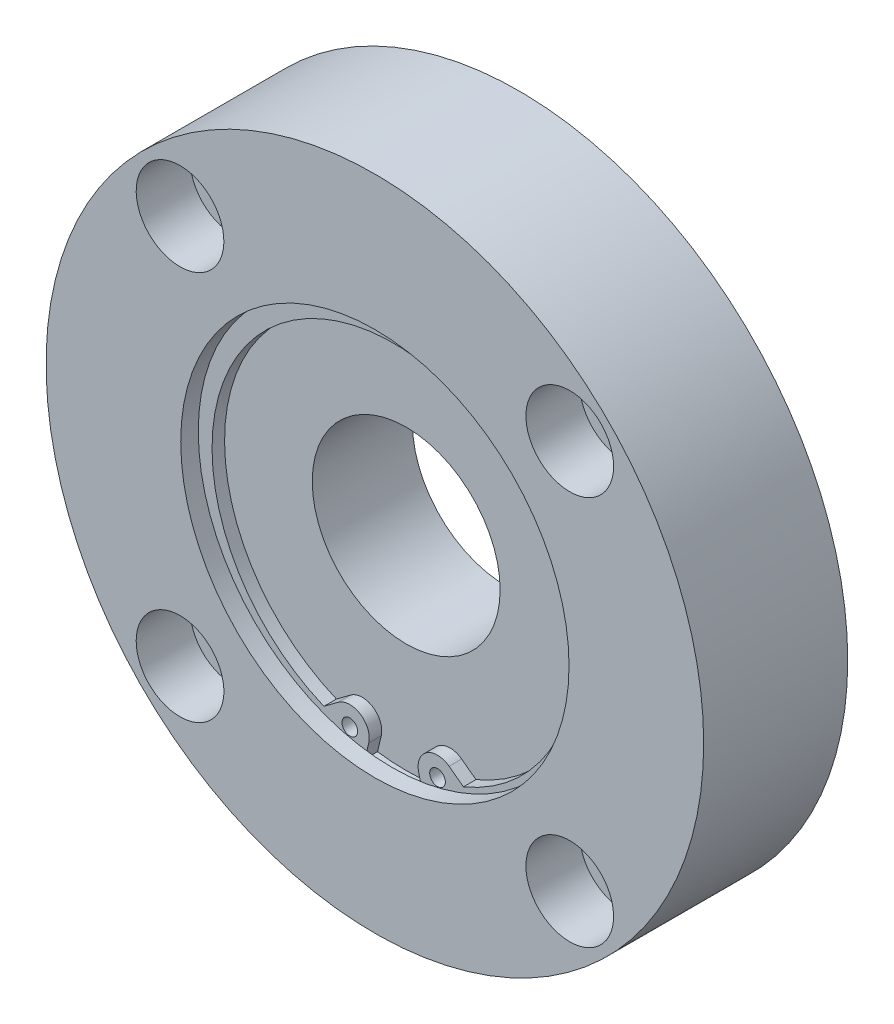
ISO-10303-21;
HEADER;
FILE_DESCRIPTION(('STEP AP214'),'2;1');
FILE_NAME('part.step','',(''),(''),'','','');
FILE_SCHEMA(('AUTOMOTIVE_DESIGN { 1 0 10303 214 1 1 1 1 }'));
ENDSEC;
DATA;
#1=APPLICATION_CONTEXT('core data for automotive mechanical design processes');
#2=APPLICATION_PROTOCOL_DEFINITION('international standard','automotive_design',2000,#1);
#3=PRODUCT_CONTEXT('',#1,'mechanical');
#4=PRODUCT('Part','Part','',(#3));
#5=PRODUCT_RELATED_PRODUCT_CATEGORY('part','',(#4));
#6=PRODUCT_DEFINITION_FORMATION('','',#4);
#7=PRODUCT_DEFINITION_CONTEXT('part definition',#1,'design');
#8=PRODUCT_DEFINITION('design','',#6,#7);
#9=PRODUCT_DEFINITION_SHAPE('','',#8);
#10=(LENGTH_UNIT() NAMED_UNIT(*) SI_UNIT(.MILLI.,.METRE.));
#11=(NAMED_UNIT(*) PLANE_ANGLE_UNIT() SI_UNIT($,.RADIAN.));
#12=(NAMED_UNIT(*) SI_UNIT($,.STERADIAN.) SOLID_ANGLE_UNIT());
#13=UNCERTAINTY_MEASURE_WITH_UNIT(LENGTH_MEASURE(1.E-05),#10,'distance_accuracy_value','');
#14=(GEOMETRIC_REPRESENTATION_CONTEXT(3) GLOBAL_UNCERTAINTY_ASSIGNED_CONTEXT((#13)) GLOBAL_UNIT_ASSIGNED_CONTEXT((#10,
#11,#12)) REPRESENTATION_CONTEXT('',''));
#15=CARTESIAN_POINT('',(0.,0.,0.));
#16=DIRECTION('',(0.,0.,1.));
#17=DIRECTION('',(1.,0.,0.));
#18=AXIS2_PLACEMENT_3D('',#15,#16,#17);
#19=CARTESIAN_POINT('',(31.112698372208,31.1126983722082,0.));
#20=DIRECTION('',(0.,0.,1.));
#21=DIRECTION('',(1.,0.,0.));
#22=AXIS2_PLACEMENT_3D('',#19,#20,#21);
#23=CYLINDRICAL_SURFACE('',#22,5.);
#24=CARTESIAN_POINT('',(31.112698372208,31.1126983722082,0.));
#25=DIRECTION('',(0.,0.,1.));
#26=DIRECTION('',(1.,0.,0.));
#27=AXIS2_PLACEMENT_3D('',#24,#25,#26);
#28=CIRCLE('',#27,5.);
#29=CARTESIAN_POINT('',(36.112698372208,31.1126983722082,0.));
#30=VERTEX_POINT('',#29);
#31=EDGE_CURVE('E231',#30,#30,#28,.T.);
#32=ORIENTED_EDGE('',*,*,#31,.F.);
#33=EDGE_LOOP('',(#32));
#34=FACE_BOUND('',#33,.T.);
#35=CARTESIAN_POINT('',(31.112698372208,31.1126983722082,14.4));
#36=DIRECTION('',(0.,0.,1.));
#37=DIRECTION('',(1.,0.,0.));
#38=AXIS2_PLACEMENT_3D('',#35,#36,#37);
#39=CIRCLE('',#38,5.);
#40=CARTESIAN_POINT('',(36.112698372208,31.1126983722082,14.4));
#41=VERTEX_POINT('',#40);
#42=EDGE_CURVE('E230',#41,#41,#39,.F.);
#43=ORIENTED_EDGE('',*,*,#42,.F.);
#44=EDGE_LOOP('',(#43));
#45=FACE_BOUND('',#44,.T.);
#46=ADVANCED_FACE('F14',(#34,#45),#23,.F.);
#47=CARTESIAN_POINT('',(31.1126983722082,-31.1126983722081,0.));
#48=DIRECTION('',(0.,0.,1.));
#49=DIRECTION('',(1.,0.,0.));
#50=AXIS2_PLACEMENT_3D('',#47,#48,#49);
#51=CYLINDRICAL_SURFACE('',#50,5.);
#52=CARTESIAN_POINT('',(31.1126983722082,-31.1126983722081,0.));
#53=DIRECTION('',(0.,0.,1.));
#54=DIRECTION('',(0.,-1.,0.));
#55=AXIS2_PLACEMENT_3D('',#52,#53,#54);
#56=CIRCLE('',#55,5.);
#57=CARTESIAN_POINT('',(31.1126983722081,-36.1126983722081,0.));
#58=VERTEX_POINT('',#57);
#59=EDGE_CURVE('E221',#58,#58,#56,.T.);
#60=ORIENTED_EDGE('',*,*,#59,.F.);
#61=EDGE_LOOP('',(#60));
#62=FACE_BOUND('',#61,.T.);
#63=CARTESIAN_POINT('',(31.1126983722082,-31.1126983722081,14.4));
#64=DIRECTION('',(0.,0.,1.));
#65=DIRECTION('',(1.,0.,0.));
#66=AXIS2_PLACEMENT_3D('',#63,#64,#65);
#67=CIRCLE('',#66,5.);
#68=CARTESIAN_POINT('',(36.1126983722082,-31.1126983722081,14.4));
#69=VERTEX_POINT('',#68);
#70=EDGE_CURVE('E214',#69,#69,#67,.F.);
#71=ORIENTED_EDGE('',*,*,#70,.F.);
#72=EDGE_LOOP('',(#71));
#73=FACE_BOUND('',#72,.T.);
#74=ADVANCED_FACE('F320',(#62,#73),#51,.F.);
#75=CARTESIAN_POINT('',(-31.1126983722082,-31.1126983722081,0.));
#76=DIRECTION('',(0.,0.,1.));
#77=DIRECTION('',(1.,0.,0.));
#78=AXIS2_PLACEMENT_3D('',#75,#76,#77);
#79=CYLINDRICAL_SURFACE('',#78,5.);
#80=CARTESIAN_POINT('',(-31.1126983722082,-31.1126983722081,0.));
#81=DIRECTION('',(0.,0.,1.));
#82=DIRECTION('',(-1.,0.,0.));
#83=AXIS2_PLACEMENT_3D('',#80,#81,#82);
#84=CIRCLE('',#83,5.);
#85=CARTESIAN_POINT('',(-36.1126983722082,-31.112698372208,0.));
#86=VERTEX_POINT('',#85);
#87=EDGE_CURVE('E218',#86,#86,#84,.T.);
#88=ORIENTED_EDGE('',*,*,#87,.F.);
#89=EDGE_LOOP('',(#88));
#90=FACE_BOUND('',#89,.T.);
#91=CARTESIAN_POINT('',(-31.1126983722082,-31.1126983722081,14.4));
#92=DIRECTION('',(0.,0.,1.));
#93=DIRECTION('',(1.,0.,0.));
#94=AXIS2_PLACEMENT_3D('',#91,#92,#93);
#95=CIRCLE('',#94,5.);
#96=CARTESIAN_POINT('',(-26.1126983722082,-31.1126983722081,14.4));
#97=VERTEX_POINT('',#96);
#98=EDGE_CURVE('E207',#97,#97,#95,.F.);
#99=ORIENTED_EDGE('',*,*,#98,.F.);
#100=EDGE_LOOP('',(#99));
#101=FACE_BOUND('',#100,.T.);
#102=ADVANCED_FACE('F326',(#90,#101),#79,.F.);
#103=CARTESIAN_POINT('',(-31.1126983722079,31.1126983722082,0.));
#104=DIRECTION('',(0.,0.,1.));
#105=DIRECTION('',(1.,0.,0.));
#106=AXIS2_PLACEMENT_3D('',#103,#104,#105);
#107=CYLINDRICAL_SURFACE('',#106,5.);
#108=CARTESIAN_POINT('',(-31.1126983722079,31.1126983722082,0.));
#109=DIRECTION('',(0.,0.,1.));
#110=DIRECTION('',(0.,1.,0.));
#111=AXIS2_PLACEMENT_3D('',#108,#109,#110);
#112=CIRCLE('',#111,5.);
#113=CARTESIAN_POINT('',(-31.1126983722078,36.1126983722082,0.));
#114=VERTEX_POINT('',#113);
#115=EDGE_CURVE('E215',#114,#114,#112,.T.);
#116=ORIENTED_EDGE('',*,*,#115,.F.);
#117=EDGE_LOOP('',(#116));
#118=FACE_BOUND('',#117,.T.);
#119=CARTESIAN_POINT('',(-31.1126983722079,31.1126983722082,14.4));
#120=DIRECTION('',(0.,0.,1.));
#121=DIRECTION('',(1.,0.,0.));
#122=AXIS2_PLACEMENT_3D('',#119,#120,#121);
#123=CIRCLE('',#122,5.);
#124=CARTESIAN_POINT('',(-26.1126983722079,31.1126983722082,14.4));
#125=VERTEX_POINT('',#124);
#126=EDGE_CURVE('E200',#125,#125,#123,.F.);
#127=ORIENTED_EDGE('',*,*,#126,.F.);
#128=EDGE_LOOP('',(#127));
#129=FACE_BOUND('',#128,.T.);
#130=ADVANCED_FACE('F600',(#118,#129),#107,.F.);
#131=CARTESIAN_POINT('',(31.112698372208,31.1126983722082,14.4));
#132=DIRECTION('',(0.,0.,1.));
#133=DIRECTION('',(1.,0.,0.));
#134=AXIS2_PLACEMENT_3D('',#131,#132,#133);
#135=PLANE('',#134);
#136=CARTESIAN_POINT('',(31.112698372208,31.1126983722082,14.4));
#137=DIRECTION('',(0.,0.,1.));
#138=DIRECTION('',(1.,0.,0.));
#139=AXIS2_PLACEMENT_3D('',#136,#137,#138);
#140=CIRCLE('',#139,7.);
#141=CARTESIAN_POINT('',(38.112698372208,31.1126983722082,14.4));
#142=VERTEX_POINT('',#141);
#143=EDGE_CURVE('E227',#142,#142,#140,.T.);
#144=ORIENTED_EDGE('',*,*,#143,.T.);
#145=EDGE_LOOP('',(#144));
#146=FACE_BOUND('',#145,.T.);
#147=ORIENTED_EDGE('',*,*,#42,.T.);
#148=EDGE_LOOP('',(#147));
#149=FACE_BOUND('',#148,.T.);
#150=ADVANCED_FACE('F591',(#146,#149),#135,.T.);
#151=CARTESIAN_POINT('',(31.1126983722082,-31.1126983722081,14.4));
#152=DIRECTION('',(0.,0.,1.));
#153=DIRECTION('',(0.,-1.,0.));
#154=AXIS2_PLACEMENT_3D('',#151,#152,#153);
#155=PLANE('',#154);
#156=CARTESIAN_POINT('',(31.1126983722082,-31.1126983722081,14.4));
#157=DIRECTION('',(0.,0.,1.));
#158=DIRECTION('',(0.,-1.,0.));
#159=AXIS2_PLACEMENT_3D('',#156,#157,#158);
#160=CIRCLE('',#159,7.);
#161=CARTESIAN_POINT('',(31.1126983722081,-38.1126983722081,14.4));
#162=VERTEX_POINT('',#161);
#163=EDGE_CURVE('E211',#162,#162,#160,.T.);
#164=ORIENTED_EDGE('',*,*,#163,.T.);
#165=EDGE_LOOP('',(#164));
#166=FACE_BOUND('',#165,.T.);
#167=ORIENTED_EDGE('',*,*,#70,.T.);
#168=EDGE_LOOP('',(#167));
#169=FACE_BOUND('',#168,.T.);
#170=ADVANCED_FACE('F581',(#166,#169),#155,.T.);
#171=CARTESIAN_POINT('',(-31.1126983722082,-31.1126983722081,14.4));
#172=DIRECTION('',(0.,0.,1.));
#173=DIRECTION('',(-1.,0.,0.));
#174=AXIS2_PLACEMENT_3D('',#171,#172,#173);
#175=PLANE('',#174);
#176=CARTESIAN_POINT('',(-31.1126983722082,-31.1126983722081,14.4));
#177=DIRECTION('',(0.,0.,1.));
#178=DIRECTION('',(-1.,0.,0.));
#179=AXIS2_PLACEMENT_3D('',#176,#177,#178);
#180=CIRCLE('',#179,7.);
#181=CARTESIAN_POINT('',(-38.1126983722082,-31.112698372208,14.4));
#182=VERTEX_POINT('',#181);
#183=EDGE_CURVE('E204',#182,#182,#180,.T.);
#184=ORIENTED_EDGE('',*,*,#183,.T.);
#185=EDGE_LOOP('',(#184));
#186=FACE_BOUND('',#185,.T.);
#187=ORIENTED_EDGE('',*,*,#98,.T.);
#188=EDGE_LOOP('',(#187));
#189=FACE_BOUND('',#188,.T.);
#190=ADVANCED_FACE('F572',(#186,#189),#175,.T.);
#191=CARTESIAN_POINT('',(-31.1126983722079,31.1126983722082,14.4));
#192=DIRECTION('',(0.,0.,1.));
#193=DIRECTION('',(0.,1.,0.));
#194=AXIS2_PLACEMENT_3D('',#191,#192,#193);
#195=PLANE('',#194);
#196=CARTESIAN_POINT('',(-31.1126983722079,31.1126983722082,14.4));
#197=DIRECTION('',(0.,0.,1.));
#198=DIRECTION('',(0.,1.,0.));
#199=AXIS2_PLACEMENT_3D('',#196,#197,#198);
#200=CIRCLE('',#199,7.);
#201=CARTESIAN_POINT('',(-31.1126983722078,38.1126983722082,14.4));
#202=VERTEX_POINT('',#201);
#203=EDGE_CURVE('E197',#202,#202,#200,.T.);
#204=ORIENTED_EDGE('',*,*,#203,.T.);
#205=EDGE_LOOP('',(#204));
#206=FACE_BOUND('',#205,.T.);
#207=ORIENTED_EDGE('',*,*,#126,.T.);
#208=EDGE_LOOP('',(#207));
#209=FACE_BOUND('',#208,.T.);
#210=ADVANCED_FACE('F344',(#206,#209),#195,.T.);
#211=CARTESIAN_POINT('',(0.,0.,0.));
#212=DIRECTION('',(0.,0.,1.));
#213=DIRECTION('',(1.,0.,0.));
#214=AXIS2_PLACEMENT_3D('',#211,#212,#213);
#215=PLANE('',#214);
#216=CARTESIAN_POINT('',(0.,0.,0.));
#217=DIRECTION('',(0.,0.,-1.));
#218=DIRECTION('',(-1.,0.,0.));
#219=AXIS2_PLACEMENT_3D('',#216,#217,#218);
#220=CIRCLE('',#219,27.5);
#221=CARTESIAN_POINT('',(-27.5,0.,0.));
#222=VERTEX_POINT('',#221);
#223=EDGE_CURVE('E183',#222,#222,#220,.T.);
#224=ORIENTED_EDGE('',*,*,#223,.F.);
#225=EDGE_LOOP('',(#224));
#226=FACE_BOUND('',#225,.T.);
#227=ORIENTED_EDGE('',*,*,#115,.T.);
#228=EDGE_LOOP('',(#227));
#229=FACE_BOUND('',#228,.T.);
#230=ORIENTED_EDGE('',*,*,#87,.T.);
#231=EDGE_LOOP('',(#230));
#232=FACE_BOUND('',#231,.T.);
#233=ORIENTED_EDGE('',*,*,#59,.T.);
#234=EDGE_LOOP('',(#233));
#235=FACE_BOUND('',#234,.T.);
#236=ORIENTED_EDGE('',*,*,#31,.T.);
#237=EDGE_LOOP('',(#236));
#238=FACE_BOUND('',#237,.T.);
#239=CARTESIAN_POINT('',(0.,0.,0.));
#240=DIRECTION('',(0.,0.,1.));
#241=DIRECTION('',(1.,0.,0.));
#242=AXIS2_PLACEMENT_3D('',#239,#240,#241);
#243=CIRCLE('',#242,52.5);
#244=CARTESIAN_POINT('',(52.5,0.,0.));
#245=VERTEX_POINT('',#244);
#246=EDGE_CURVE('E234',#245,#245,#243,.T.);
#247=ORIENTED_EDGE('',*,*,#246,.F.);
#248=EDGE_LOOP('',(#247));
#249=FACE_BOUND('',#248,.T.);
#250=ADVANCED_FACE('F340',(#226,#229,#232,#235,#238,#249),#215,.F.);
#251=CARTESIAN_POINT('',(0.,0.,23.));
#252=DIRECTION('',(0.,0.,-1.));
#253=DIRECTION('',(-1.,0.,0.));
#254=AXIS2_PLACEMENT_3D('',#251,#252,#253);
#255=CYLINDRICAL_SURFACE('',#254,52.5);
#256=CARTESIAN_POINT('',(0.,0.,23.));
#257=DIRECTION('',(0.,0.,1.));
#258=DIRECTION('',(1.,0.,0.));
#259=AXIS2_PLACEMENT_3D('',#256,#257,#258);
#260=CIRCLE('',#259,52.5);
#261=CARTESIAN_POINT('',(52.5,0.,23.));
#262=VERTEX_POINT('',#261);
#263=EDGE_CURVE('E237',#262,#262,#260,.T.);
#264=ORIENTED_EDGE('',*,*,#263,.F.);
#265=EDGE_LOOP('',(#264));
#266=FACE_BOUND('',#265,.T.);
#267=ORIENTED_EDGE('',*,*,#246,.T.);
#268=EDGE_LOOP('',(#267));
#269=FACE_BOUND('',#268,.T.);
#270=ADVANCED_FACE('F343',(#266,#269),#255,.T.);
#271=CARTESIAN_POINT('',(31.112698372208,31.1126983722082,14.4));
#272=DIRECTION('',(0.,0.,1.));
#273=DIRECTION('',(1.,0.,0.));
#274=AXIS2_PLACEMENT_3D('',#271,#272,#273);
#275=CYLINDRICAL_SURFACE('',#274,7.);
#276=ORIENTED_EDGE('',*,*,#143,.F.);
#277=EDGE_LOOP('',(#276));
#278=FACE_BOUND('',#277,.T.);
#279=CARTESIAN_POINT('',(31.112698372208,31.1126983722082,23.));
#280=DIRECTION('',(0.,0.,1.));
#281=DIRECTION('',(1.,0.,0.));
#282=AXIS2_PLACEMENT_3D('',#279,#280,#281);
#283=CIRCLE('',#282,7.);
#284=CARTESIAN_POINT('',(38.112698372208,31.1126983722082,23.));
#285=VERTEX_POINT('',#284);
#286=EDGE_CURVE('E224',#285,#285,#283,.T.);
#287=ORIENTED_EDGE('',*,*,#286,.T.);
#288=EDGE_LOOP('',(#287));
#289=FACE_BOUND('',#288,.T.);
#290=ADVANCED_FACE('F333',(#278,#289),#275,.F.);
#291=CARTESIAN_POINT('',(31.1126983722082,-31.1126983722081,14.4));
#292=DIRECTION('',(0.,0.,1.));
#293=DIRECTION('',(1.,0.,0.));
#294=AXIS2_PLACEMENT_3D('',#291,#292,#293);
#295=CYLINDRICAL_SURFACE('',#294,7.);
#296=ORIENTED_EDGE('',*,*,#163,.F.);
#297=EDGE_LOOP('',(#296));
#298=FACE_BOUND('',#297,.T.);
#299=CARTESIAN_POINT('',(31.1126983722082,-31.1126983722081,23.));
#300=DIRECTION('',(0.,0.,1.));
#301=DIRECTION('',(0.,-1.,0.));
#302=AXIS2_PLACEMENT_3D('',#299,#300,#301);
#303=CIRCLE('',#302,7.);
#304=CARTESIAN_POINT('',(31.1126983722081,-38.1126983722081,23.));
#305=VERTEX_POINT('',#304);
#306=EDGE_CURVE('E208',#305,#305,#303,.T.);
#307=ORIENTED_EDGE('',*,*,#306,.T.);
#308=EDGE_LOOP('',(#307));
#309=FACE_BOUND('',#308,.T.);
#310=ADVANCED_FACE('F532',(#298,#309),#295,.F.);
#311=CARTESIAN_POINT('',(-31.1126983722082,-31.1126983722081,14.4));
#312=DIRECTION('',(0.,0.,1.));
#313=DIRECTION('',(1.,0.,0.));
#314=AXIS2_PLACEMENT_3D('',#311,#312,#313);
#315=CYLINDRICAL_SURFACE('',#314,7.);
#316=ORIENTED_EDGE('',*,*,#183,.F.);
#317=EDGE_LOOP('',(#316));
#318=FACE_BOUND('',#317,.T.);
#319=CARTESIAN_POINT('',(-31.1126983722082,-31.1126983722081,23.));
#320=DIRECTION('',(0.,0.,1.));
#321=DIRECTION('',(-1.,0.,0.));
#322=AXIS2_PLACEMENT_3D('',#319,#320,#321);
#323=CIRCLE('',#322,7.);
#324=CARTESIAN_POINT('',(-38.1126983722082,-31.112698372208,23.));
#325=VERTEX_POINT('',#324);
#326=EDGE_CURVE('E201',#325,#325,#323,.T.);
#327=ORIENTED_EDGE('',*,*,#326,.T.);
#328=EDGE_LOOP('',(#327));
#329=FACE_BOUND('',#328,.T.);
#330=ADVANCED_FACE('F521',(#318,#329),#315,.F.);
#331=CARTESIAN_POINT('',(-31.1126983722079,31.1126983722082,14.4));
#332=DIRECTION('',(0.,0.,1.));
#333=DIRECTION('',(1.,0.,0.));
#334=AXIS2_PLACEMENT_3D('',#331,#332,#333);
#335=CYLINDRICAL_SURFACE('',#334,7.);
#336=ORIENTED_EDGE('',*,*,#203,.F.);
#337=EDGE_LOOP('',(#336));
#338=FACE_BOUND('',#337,.T.);
#339=CARTESIAN_POINT('',(-31.1126983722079,31.1126983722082,23.));
#340=DIRECTION('',(0.,0.,1.));
#341=DIRECTION('',(0.,1.,0.));
#342=AXIS2_PLACEMENT_3D('',#339,#340,#341);
#343=CIRCLE('',#342,7.);
#344=CARTESIAN_POINT('',(-31.1126983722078,38.1126983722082,23.));
#345=VERTEX_POINT('',#344);
#346=EDGE_CURVE('E194',#345,#345,#343,.T.);
#347=ORIENTED_EDGE('',*,*,#346,.T.);
#348=EDGE_LOOP('',(#347));
#349=FACE_BOUND('',#348,.T.);
#350=ADVANCED_FACE('F511',(#338,#349),#335,.F.);
#351=CARTESIAN_POINT('',(0.,0.,2.));
#352=DIRECTION('',(0.,0.,-1.));
#353=DIRECTION('',(-1.,0.,0.));
#354=AXIS2_PLACEMENT_3D('',#351,#352,#353);
#355=CYLINDRICAL_SURFACE('',#354,27.5);
#356=CARTESIAN_POINT('',(0.,0.,2.));
#357=DIRECTION('',(0.,0.,-1.));
#358=DIRECTION('',(-1.,0.,0.));
#359=AXIS2_PLACEMENT_3D('',#356,#357,#358);
#360=CIRCLE('',#359,27.5);
#361=CARTESIAN_POINT('',(-27.5,0.,2.));
#362=VERTEX_POINT('',#361);
#363=EDGE_CURVE('E186',#362,#362,#360,.T.);
#364=ORIENTED_EDGE('',*,*,#363,.F.);
#365=EDGE_LOOP('',(#364));
#366=FACE_BOUND('',#365,.T.);
#367=ORIENTED_EDGE('',*,*,#223,.T.);
#368=EDGE_LOOP('',(#367));
#369=FACE_BOUND('',#368,.T.);
#370=ADVANCED_FACE('F350',(#366,#369),#355,.F.);
#371=CARTESIAN_POINT('',(0.,0.,23.));
#372=DIRECTION('',(0.,0.,1.));
#373=DIRECTION('',(1.,0.,0.));
#374=AXIS2_PLACEMENT_3D('',#371,#372,#373);
#375=PLANE('',#374);
#376=CARTESIAN_POINT('',(0.,0.,23.));
#377=DIRECTION('',(0.,0.,1.));
#378=DIRECTION('',(1.,0.,0.));
#379=AXIS2_PLACEMENT_3D('',#376,#377,#378);
#380=CIRCLE('',#379,31.);
#381=CARTESIAN_POINT('',(31.,0.,23.));
#382=VERTEX_POINT('',#381);
#383=EDGE_CURVE('E190',#382,#382,#380,.T.);
#384=ORIENTED_EDGE('',*,*,#383,.F.);
#385=EDGE_LOOP('',(#384));
#386=FACE_BOUND('',#385,.T.);
#387=ORIENTED_EDGE('',*,*,#346,.F.);
#388=EDGE_LOOP('',(#387));
#389=FACE_BOUND('',#388,.T.);
#390=ORIENTED_EDGE('',*,*,#326,.F.);
#391=EDGE_LOOP('',(#390));
#392=FACE_BOUND('',#391,.T.);
#393=ORIENTED_EDGE('',*,*,#306,.F.);
#394=EDGE_LOOP('',(#393));
#395=FACE_BOUND('',#394,.T.);
#396=ORIENTED_EDGE('',*,*,#286,.F.);
#397=EDGE_LOOP('',(#396));
#398=FACE_BOUND('',#397,.T.);
#399=ORIENTED_EDGE('',*,*,#263,.T.);
#400=EDGE_LOOP('',(#399));
#401=FACE_BOUND('',#400,.T.);
#402=ADVANCED_FACE('F346',(#386,#389,#392,#395,#398,#401),#375,.T.);
#403=CARTESIAN_POINT('',(0.,0.,2.));
#404=DIRECTION('',(0.,0.,-1.));
#405=DIRECTION('',(-1.,0.,0.));
#406=AXIS2_PLACEMENT_3D('',#403,#404,#405);
#407=PLANE('',#406);
#408=CARTESIAN_POINT('',(0.,0.,2.));
#409=DIRECTION('',(0.,0.,-1.));
#410=DIRECTION('',(-1.,0.,0.));
#411=AXIS2_PLACEMENT_3D('',#408,#409,#410);
#412=CIRCLE('',#411,15.);
#413=CARTESIAN_POINT('',(-15.,0.,2.));
#414=VERTEX_POINT('',#413);
#415=EDGE_CURVE('E189',#414,#414,#412,.T.);
#416=ORIENTED_EDGE('',*,*,#415,.F.);
#417=EDGE_LOOP('',(#416));
#418=FACE_BOUND('',#417,.T.);
#419=ORIENTED_EDGE('',*,*,#363,.T.);
#420=EDGE_LOOP('',(#419));
#421=FACE_BOUND('',#420,.T.);
#422=ADVANCED_FACE('F349',(#418,#421),#407,.T.);
#423=CARTESIAN_POINT('',(0.,0.,18.));
#424=DIRECTION('',(0.,0.,1.));
#425=DIRECTION('',(1.,0.,0.));
#426=AXIS2_PLACEMENT_3D('',#423,#424,#425);
#427=CYLINDRICAL_SURFACE('',#426,31.);
#428=CARTESIAN_POINT('',(0.,0.,20.2));
#429=DIRECTION('',(0.,0.,1.));
#430=DIRECTION('',(1.,0.,0.));
#431=AXIS2_PLACEMENT_3D('',#428,#429,#430);
#432=CIRCLE('',#431,31.);
#433=CARTESIAN_POINT('',(31.,0.,20.2));
#434=VERTEX_POINT('',#433);
#435=EDGE_CURVE('E180',#434,#434,#432,.F.);
#436=ORIENTED_EDGE('',*,*,#435,.T.);
#437=EDGE_LOOP('',(#436));
#438=FACE_BOUND('',#437,.T.);
#439=ORIENTED_EDGE('',*,*,#383,.T.);
#440=EDGE_LOOP('',(#439));
#441=FACE_BOUND('',#440,.T.);
#442=ADVANCED_FACE('F338',(#438,#441),#427,.F.);
#443=CARTESIAN_POINT('',(0.,0.,23.));
#444=DIRECTION('',(0.,0.,-1.));
#445=DIRECTION('',(-1.,0.,0.));
#446=AXIS2_PLACEMENT_3D('',#443,#444,#445);
#447=CYLINDRICAL_SURFACE('',#446,15.);
#448=CARTESIAN_POINT('',(0.,0.,18.));
#449=DIRECTION('',(0.,0.,1.));
#450=DIRECTION('',(1.,0.,0.));
#451=AXIS2_PLACEMENT_3D('',#448,#449,#450);
#452=CIRCLE('',#451,15.);
#453=CARTESIAN_POINT('',(15.,0.,18.));
#454=VERTEX_POINT('',#453);
#455=EDGE_CURVE('E193',#454,#454,#452,.T.);
#456=ORIENTED_EDGE('',*,*,#455,.T.);
#457=EDGE_LOOP('',(#456));
#458=FACE_BOUND('',#457,.T.);
#459=ORIENTED_EDGE('',*,*,#415,.T.);
#460=EDGE_LOOP('',(#459));
#461=FACE_BOUND('',#460,.T.);
#462=ADVANCED_FACE('F335',(#458,#461),#447,.F.);
#463=CARTESIAN_POINT('',(0.,0.,18.));
#464=DIRECTION('',(0.,0.,1.));
#465=DIRECTION('',(1.,0.,0.));
#466=AXIS2_PLACEMENT_3D('',#463,#464,#465);
#467=PLANE('',#466);
#468=ORIENTED_EDGE('',*,*,#455,.F.);
#469=EDGE_LOOP('',(#468));
#470=FACE_BOUND('',#469,.T.);
#471=CARTESIAN_POINT('',(0.,0.,18.));
#472=DIRECTION('',(0.,0.,1.));
#473=DIRECTION('',(1.,0.,0.));
#474=AXIS2_PLACEMENT_3D('',#471,#472,#473);
#475=CIRCLE('',#474,32.5);
#476=CARTESIAN_POINT('',(-4.57780651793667,-32.1759799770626,18.));
#477=VERTEX_POINT('',#476);
#478=CARTESIAN_POINT('',(4.57780651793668,-32.1759799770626,18.));
#479=VERTEX_POINT('',#478);
#480=EDGE_CURVE('E171',#477,#479,#475,.T.);
#481=ORIENTED_EDGE('',*,*,#480,.T.);
#482=DIRECTION('',(-0.231349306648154,0.972870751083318,0.));
#483=VECTOR('',#482,1.);
#484=CARTESIAN_POINT('',(-2.90915263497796,-0.691798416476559,18.));
#485=LINE('',#484,#483);
#486=CARTESIAN_POINT('',(3.98410067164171,-29.6793264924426,18.));
#487=VERTEX_POINT('',#486);
#488=EDGE_CURVE('E9',#479,#487,#485,.T.);
#489=ORIENTED_EDGE('',*,*,#488,.T.);
#490=CARTESIAN_POINT('',(7.,-28.9621436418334,18.));
#491=DIRECTION('',(0.,0.,1.));
#492=DIRECTION('',(1.,0.,0.));
#493=AXIS2_PLACEMENT_3D('',#490,#491,#492);
#494=CIRCLE('',#493,3.1);
#495=CARTESIAN_POINT('',(8.84931667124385,-26.4741669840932,18.));
#496=VERTEX_POINT('',#495);
#497=EDGE_CURVE('E25',#496,#487,#494,.T.);
#498=ORIENTED_EDGE('',*,*,#497,.F.);
#499=DIRECTION('',(0.802573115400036,-0.596553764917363,0.));
#500=VECTOR('',#499,1.);
#501=CARTESIAN_POINT('',(-9.52598617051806,-12.8157776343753,18.));
#502=LINE('',#501,#500);
#503=CARTESIAN_POINT('',(11.1384133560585,-28.1756558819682,18.));
#504=VERTEX_POINT('',#503);
#505=EDGE_CURVE('E102',#496,#504,#502,.T.);
#506=ORIENTED_EDGE('',*,*,#505,.T.);
#507=CARTESIAN_POINT('',(0.,-1.4,18.));
#508=DIRECTION('',(0.,0.,1.));
#509=DIRECTION('',(1.,0.,0.));
#510=AXIS2_PLACEMENT_3D('',#507,#508,#509);
#511=CIRCLE('',#510,29.);
#512=CARTESIAN_POINT('',(-11.1384133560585,-28.1756558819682,18.));
#513=VERTEX_POINT('',#512);
#514=EDGE_CURVE('E106',#504,#513,#511,.T.);
#515=ORIENTED_EDGE('',*,*,#514,.T.);
#516=DIRECTION('',(0.802573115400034,0.596553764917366,0.));
#517=VECTOR('',#516,1.);
#518=CARTESIAN_POINT('',(9.52598617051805,-12.8157776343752,18.));
#519=LINE('',#518,#517);
#520=CARTESIAN_POINT('',(-8.84931667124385,-26.4741669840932,18.));
#521=VERTEX_POINT('',#520);
#522=EDGE_CURVE('E120',#513,#521,#519,.T.);
#523=ORIENTED_EDGE('',*,*,#522,.T.);
#524=CARTESIAN_POINT('',(-7.,-28.9621436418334,18.));
#525=DIRECTION('',(0.,0.,1.));
#526=DIRECTION('',(1.,0.,0.));
#527=AXIS2_PLACEMENT_3D('',#524,#525,#526);
#528=CIRCLE('',#527,3.1);
#529=CARTESIAN_POINT('',(-3.98410067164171,-29.6793264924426,18.));
#530=VERTEX_POINT('',#529);
#531=EDGE_CURVE('E268',#530,#521,#528,.T.);
#532=ORIENTED_EDGE('',*,*,#531,.F.);
#533=DIRECTION('',(-0.231349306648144,-0.97287075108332,0.));
#534=VECTOR('',#533,1.);
#535=CARTESIAN_POINT('',(2.90915263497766,-0.691798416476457,18.));
#536=LINE('',#535,#534);
#537=EDGE_CURVE('E271',#530,#477,#536,.T.);
#538=ORIENTED_EDGE('',*,*,#537,.T.);
#539=EDGE_LOOP('',(#481,#489,#498,#506,#515,#523,#532,#538));
#540=FACE_BOUND('',#539,.T.);
#541=ADVANCED_FACE('F105',(#470,#540),#467,.T.);
#542=CARTESIAN_POINT('',(0.,0.,20.2));
#543=DIRECTION('',(0.,0.,1.));
#544=DIRECTION('',(1.,0.,0.));
#545=AXIS2_PLACEMENT_3D('',#542,#543,#544);
#546=PLANE('',#545);
#547=CARTESIAN_POINT('',(0.,0.,20.2));
#548=DIRECTION('',(0.,0.,1.));
#549=DIRECTION('',(1.,0.,0.));
#550=AXIS2_PLACEMENT_3D('',#547,#548,#549);
#551=CIRCLE('',#550,32.5);
#552=CARTESIAN_POINT('',(32.5,0.,20.2));
#553=VERTEX_POINT('',#552);
#554=EDGE_CURVE('E176',#553,#553,#551,.T.);
#555=ORIENTED_EDGE('',*,*,#554,.F.);
#556=EDGE_LOOP('',(#555));
#557=FACE_BOUND('',#556,.T.);
#558=ORIENTED_EDGE('',*,*,#435,.F.);
#559=EDGE_LOOP('',(#558));
#560=FACE_BOUND('',#559,.T.);
#561=ADVANCED_FACE('F451',(#557,#560),#546,.F.);
#562=CARTESIAN_POINT('',(0.,0.,20.2));
#563=DIRECTION('',(0.,0.,-1.));
#564=DIRECTION('',(-1.,0.,0.));
#565=AXIS2_PLACEMENT_3D('',#562,#563,#564);
#566=CYLINDRICAL_SURFACE('',#565,32.5);
#567=ORIENTED_EDGE('',*,*,#554,.T.);
#568=EDGE_LOOP('',(#567));
#569=FACE_BOUND('',#568,.T.);
#570=CARTESIAN_POINT('',(0.,0.,20.));
#571=DIRECTION('',(0.,0.,-1.));
#572=DIRECTION('',(-1.,0.,0.));
#573=AXIS2_PLACEMENT_3D('',#570,#571,#572);
#574=CIRCLE('',#573,32.5);
#575=CARTESIAN_POINT('',(-4.57780651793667,-32.1759799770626,20.));
#576=VERTEX_POINT('',#575);
#577=CARTESIAN_POINT('',(4.57780651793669,-32.1759799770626,20.));
#578=VERTEX_POINT('',#577);
#579=EDGE_CURVE('E255',#576,#578,#574,.T.);
#580=ORIENTED_EDGE('',*,*,#579,.T.);
#581=DIRECTION('',(0.,0.,-1.));
#582=VECTOR('',#581,1.);
#583=CARTESIAN_POINT('',(4.57780651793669,-32.1759799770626,20.2));
#584=LINE('',#583,#582);
#585=EDGE_CURVE('E258',#578,#479,#584,.T.);
#586=ORIENTED_EDGE('',*,*,#585,.T.);
#587=ORIENTED_EDGE('',*,*,#480,.F.);
#588=DIRECTION('',(0.,0.,-1.));
#589=VECTOR('',#588,1.);
#590=CARTESIAN_POINT('',(-4.57780651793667,-32.1759799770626,20.2));
#591=LINE('',#590,#589);
#592=EDGE_CURVE('E74',#477,#576,#591,.F.);
#593=ORIENTED_EDGE('',*,*,#592,.T.);
#594=EDGE_LOOP('',(#580,#586,#587,#593));
#595=FACE_BOUND('',#594,.T.);
#596=ADVANCED_FACE('F290',(#569,#595),#566,.F.);
#597=CARTESIAN_POINT('',(7.,-28.9621436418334,18.));
#598=DIRECTION('',(0.,0.,1.));
#599=DIRECTION('',(1.,0.,0.));
#600=AXIS2_PLACEMENT_3D('',#597,#598,#599);
#601=CIRCLE('',#600,1.25);
#602=CARTESIAN_POINT('',(8.25,-28.9621436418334,18.));
#603=VERTEX_POINT('',#602);
#604=EDGE_CURVE('E260',#603,#603,#601,.T.);
#605=ORIENTED_EDGE('',*,*,#604,.T.);
#606=EDGE_LOOP('',(#605));
#607=FACE_BOUND('',#606,.T.);
#608=ADVANCED_FACE('F314',(#607),#467,.T.);
#609=CARTESIAN_POINT('',(-7.,-28.9621436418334,18.));
#610=DIRECTION('',(0.,0.,1.));
#611=DIRECTION('',(1.,0.,0.));
#612=AXIS2_PLACEMENT_3D('',#609,#610,#611);
#613=CIRCLE('',#612,1.25);
#614=CARTESIAN_POINT('',(-5.75,-28.9621436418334,18.));
#615=VERTEX_POINT('',#614);
#616=EDGE_CURVE('E264',#615,#615,#613,.T.);
#617=ORIENTED_EDGE('',*,*,#616,.T.);
#618=EDGE_LOOP('',(#617));
#619=FACE_BOUND('',#618,.T.);
#620=ADVANCED_FACE('F425',(#619),#467,.T.);
#621=CARTESIAN_POINT('',(8.84931667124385,-26.4741669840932,20.));
#622=DIRECTION('',(-0.596553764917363,-0.802573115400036,0.));
#623=DIRECTION('',(-0.802573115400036,0.596553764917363,0.));
#624=AXIS2_PLACEMENT_3D('',#621,#622,#623);
#625=PLANE('',#624);
#626=ORIENTED_EDGE('',*,*,#505,.F.);
#627=DIRECTION('',(0.,0.,-1.));
#628=VECTOR('',#627,1.);
#629=CARTESIAN_POINT('',(8.84931667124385,-26.4741669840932,20.));
#630=LINE('',#629,#628);
#631=CARTESIAN_POINT('',(8.84931667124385,-26.4741669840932,20.));
#632=VERTEX_POINT('',#631);
#633=EDGE_CURVE('E135',#632,#496,#630,.T.);
#634=ORIENTED_EDGE('',*,*,#633,.F.);
#635=DIRECTION('',(-0.802573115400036,0.596553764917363,0.));
#636=VECTOR('',#635,1.);
#637=CARTESIAN_POINT('',(8.84931667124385,-26.4741669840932,20.));
#638=LINE('',#637,#636);
#639=CARTESIAN_POINT('',(11.1384133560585,-28.1756558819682,20.));
#640=VERTEX_POINT('',#639);
#641=EDGE_CURVE('E123',#640,#632,#638,.T.);
#642=ORIENTED_EDGE('',*,*,#641,.F.);
#643=DIRECTION('',(0.,0.,-1.));
#644=VECTOR('',#643,1.);
#645=CARTESIAN_POINT('',(11.1384133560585,-28.1756558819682,20.));
#646=LINE('',#645,#644);
#647=EDGE_CURVE('E116',#640,#504,#646,.T.);
#648=ORIENTED_EDGE('',*,*,#647,.T.);
#649=EDGE_LOOP('',(#626,#634,#642,#648));
#650=FACE_BOUND('',#649,.T.);
#651=ADVANCED_FACE('F16',(#650),#625,.F.);
#652=CARTESIAN_POINT('',(0.,-1.4,20.));
#653=DIRECTION('',(0.,0.,1.));
#654=DIRECTION('',(-1.,0.,0.));
#655=AXIS2_PLACEMENT_3D('',#652,#653,#654);
#656=CYLINDRICAL_SURFACE('',#655,29.);
#657=ORIENTED_EDGE('',*,*,#514,.F.);
#658=ORIENTED_EDGE('',*,*,#647,.F.);
#659=CARTESIAN_POINT('',(0.,-1.4,20.));
#660=DIRECTION('',(0.,0.,-1.));
#661=DIRECTION('',(0.,-1.,0.));
#662=AXIS2_PLACEMENT_3D('',#659,#660,#661);
#663=CIRCLE('',#662,29.);
#664=CARTESIAN_POINT('',(-11.1384133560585,-28.1756558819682,20.));
#665=VERTEX_POINT('',#664);
#666=EDGE_CURVE('E130',#665,#640,#663,.T.);
#667=ORIENTED_EDGE('',*,*,#666,.F.);
#668=DIRECTION('',(0.,0.,-1.));
#669=VECTOR('',#668,1.);
#670=CARTESIAN_POINT('',(-11.1384133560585,-28.1756558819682,20.));
#671=LINE('',#670,#669);
#672=EDGE_CURVE('E118',#665,#513,#671,.T.);
#673=ORIENTED_EDGE('',*,*,#672,.T.);
#674=EDGE_LOOP('',(#657,#658,#667,#673));
#675=FACE_BOUND('',#674,.T.);
#676=ADVANCED_FACE('F114',(#675),#656,.F.);
#677=CARTESIAN_POINT('',(-8.84931667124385,-26.4741669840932,20.));
#678=DIRECTION('',(0.596553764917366,-0.802573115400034,0.));
#679=DIRECTION('',(0.,0.,-1.));
#680=AXIS2_PLACEMENT_3D('',#677,#678,#679);
#681=PLANE('',#680);
#682=ORIENTED_EDGE('',*,*,#522,.F.);
#683=ORIENTED_EDGE('',*,*,#672,.F.);
#684=DIRECTION('',(-0.802573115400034,-0.596553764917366,0.));
#685=VECTOR('',#684,1.);
#686=CARTESIAN_POINT('',(-8.84931667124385,-26.4741669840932,20.));
#687=LINE('',#686,#685);
#688=CARTESIAN_POINT('',(-8.84931667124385,-26.4741669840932,20.));
#689=VERTEX_POINT('',#688);
#690=EDGE_CURVE('E18',#689,#665,#687,.T.);
#691=ORIENTED_EDGE('',*,*,#690,.F.);
#692=DIRECTION('',(0.,0.,-1.));
#693=VECTOR('',#692,1.);
#694=CARTESIAN_POINT('',(-8.84931667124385,-26.4741669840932,20.));
#695=LINE('',#694,#693);
#696=EDGE_CURVE('E129',#689,#521,#695,.T.);
#697=ORIENTED_EDGE('',*,*,#696,.T.);
#698=EDGE_LOOP('',(#682,#683,#691,#697));
#699=FACE_BOUND('',#698,.T.);
#700=ADVANCED_FACE('F304',(#699),#681,.F.);
#701=CARTESIAN_POINT('',(-7.,-28.9621436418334,20.));
#702=DIRECTION('',(0.,0.,1.));
#703=DIRECTION('',(-1.,0.,0.));
#704=AXIS2_PLACEMENT_3D('',#701,#702,#703);
#705=CYLINDRICAL_SURFACE('',#704,1.25);
#706=ORIENTED_EDGE('',*,*,#616,.F.);
#707=EDGE_LOOP('',(#706));
#708=FACE_BOUND('',#707,.T.);
#709=CARTESIAN_POINT('',(-7.,-28.9621436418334,20.));
#710=DIRECTION('',(0.,0.,-1.));
#711=DIRECTION('',(1.,0.,0.));
#712=AXIS2_PLACEMENT_3D('',#709,#710,#711);
#713=CIRCLE('',#712,1.25);
#714=CARTESIAN_POINT('',(-5.75,-28.9621436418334,20.));
#715=VERTEX_POINT('',#714);
#716=EDGE_CURVE('E133',#715,#715,#713,.T.);
#717=ORIENTED_EDGE('',*,*,#716,.F.);
#718=EDGE_LOOP('',(#717));
#719=FACE_BOUND('',#718,.T.);
#720=ADVANCED_FACE('F301',(#708,#719),#705,.F.);
#721=CARTESIAN_POINT('',(7.,-28.9621436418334,20.));
#722=DIRECTION('',(0.,0.,1.));
#723=DIRECTION('',(-1.,0.,0.));
#724=AXIS2_PLACEMENT_3D('',#721,#722,#723);
#725=CYLINDRICAL_SURFACE('',#724,1.25);
#726=ORIENTED_EDGE('',*,*,#604,.F.);
#727=EDGE_LOOP('',(#726));
#728=FACE_BOUND('',#727,.T.);
#729=CARTESIAN_POINT('',(7.,-28.9621436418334,20.));
#730=DIRECTION('',(0.,0.,1.));
#731=DIRECTION('',(1.,0.,0.));
#732=AXIS2_PLACEMENT_3D('',#729,#730,#731);
#733=CIRCLE('',#732,1.25);
#734=CARTESIAN_POINT('',(8.25,-28.9621436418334,20.));
#735=VERTEX_POINT('',#734);
#736=EDGE_CURVE('E156',#735,#735,#733,.T.);
#737=ORIENTED_EDGE('',*,*,#736,.T.);
#738=EDGE_LOOP('',(#737));
#739=FACE_BOUND('',#738,.T.);
#740=ADVANCED_FACE('F303',(#728,#739),#725,.F.);
#741=CARTESIAN_POINT('',(7.,-28.9621436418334,20.));
#742=DIRECTION('',(0.,0.,1.));
#743=DIRECTION('',(-1.,0.,0.));
#744=AXIS2_PLACEMENT_3D('',#741,#742,#743);
#745=CYLINDRICAL_SURFACE('',#744,3.1);
#746=ORIENTED_EDGE('',*,*,#497,.T.);
#747=DIRECTION('',(0.,0.,-1.));
#748=VECTOR('',#747,1.);
#749=CARTESIAN_POINT('',(3.98410067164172,-29.6793264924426,20.));
#750=LINE('',#749,#748);
#751=CARTESIAN_POINT('',(3.98410067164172,-29.6793264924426,20.));
#752=VERTEX_POINT('',#751);
#753=EDGE_CURVE('E138',#752,#487,#750,.T.);
#754=ORIENTED_EDGE('',*,*,#753,.F.);
#755=CARTESIAN_POINT('',(7.,-28.9621436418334,20.));
#756=DIRECTION('',(0.,0.,1.));
#757=DIRECTION('',(1.,0.,0.));
#758=AXIS2_PLACEMENT_3D('',#755,#756,#757);
#759=CIRCLE('',#758,3.1);
#760=EDGE_CURVE('E147',#632,#752,#759,.T.);
#761=ORIENTED_EDGE('',*,*,#760,.F.);
#762=ORIENTED_EDGE('',*,*,#633,.T.);
#763=EDGE_LOOP('',(#746,#754,#761,#762));
#764=FACE_BOUND('',#763,.T.);
#765=ADVANCED_FACE('F285',(#764),#745,.T.);
#766=CARTESIAN_POINT('',(0.,-1.4,20.));
#767=DIRECTION('',(0.,0.,-1.));
#768=DIRECTION('',(0.,-1.,0.));
#769=AXIS2_PLACEMENT_3D('',#766,#767,#768);
#770=PLANE('',#769);
#771=ORIENTED_EDGE('',*,*,#736,.F.);
#772=EDGE_LOOP('',(#771));
#773=FACE_BOUND('',#772,.T.);
#774=ORIENTED_EDGE('',*,*,#716,.T.);
#775=EDGE_LOOP('',(#774));
#776=FACE_BOUND('',#775,.T.);
#777=ORIENTED_EDGE('',*,*,#579,.F.);
#778=DIRECTION('',(0.231349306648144,0.97287075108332,0.));
#779=VECTOR('',#778,1.);
#780=CARTESIAN_POINT('',(-3.98410067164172,-29.6793264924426,20.));
#781=LINE('',#780,#779);
#782=CARTESIAN_POINT('',(-3.98410067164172,-29.6793264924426,20.));
#783=VERTEX_POINT('',#782);
#784=EDGE_CURVE('E148',#576,#783,#781,.T.);
#785=ORIENTED_EDGE('',*,*,#784,.T.);
#786=CARTESIAN_POINT('',(-7.,-28.9621436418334,20.));
#787=DIRECTION('',(0.,0.,1.));
#788=DIRECTION('',(-1.,0.,0.));
#789=AXIS2_PLACEMENT_3D('',#786,#787,#788);
#790=CIRCLE('',#789,3.1);
#791=EDGE_CURVE('E151',#783,#689,#790,.T.);
#792=ORIENTED_EDGE('',*,*,#791,.T.);
#793=ORIENTED_EDGE('',*,*,#690,.T.);
#794=ORIENTED_EDGE('',*,*,#666,.T.);
#795=ORIENTED_EDGE('',*,*,#641,.T.);
#796=ORIENTED_EDGE('',*,*,#760,.T.);
#797=DIRECTION('',(0.231349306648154,-0.972870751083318,0.));
#798=VECTOR('',#797,1.);
#799=CARTESIAN_POINT('',(3.98410067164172,-29.6793264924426,20.));
#800=LINE('',#799,#798);
#801=EDGE_CURVE('E143',#752,#578,#800,.T.);
#802=ORIENTED_EDGE('',*,*,#801,.T.);
#803=EDGE_LOOP('',(#777,#785,#792,#793,#794,#795,#796,#802));
#804=FACE_BOUND('',#803,.T.);
#805=ADVANCED_FACE('F282',(#773,#776,#804),#770,.F.);
#806=CARTESIAN_POINT('',(-7.,-28.9621436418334,20.));
#807=DIRECTION('',(0.,0.,1.));
#808=DIRECTION('',(-1.,0.,0.));
#809=AXIS2_PLACEMENT_3D('',#806,#807,#808);
#810=CYLINDRICAL_SURFACE('',#809,3.1);
#811=ORIENTED_EDGE('',*,*,#531,.T.);
#812=ORIENTED_EDGE('',*,*,#696,.F.);
#813=ORIENTED_EDGE('',*,*,#791,.F.);
#814=DIRECTION('',(0.,0.,-1.));
#815=VECTOR('',#814,1.);
#816=CARTESIAN_POINT('',(-3.98410067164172,-29.6793264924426,20.));
#817=LINE('',#816,#815);
#818=EDGE_CURVE('E142',#783,#530,#817,.T.);
#819=ORIENTED_EDGE('',*,*,#818,.T.);
#820=EDGE_LOOP('',(#811,#812,#813,#819));
#821=FACE_BOUND('',#820,.T.);
#822=ADVANCED_FACE('F292',(#821),#810,.T.);
#823=CARTESIAN_POINT('',(-3.98410067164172,-29.6793264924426,20.));
#824=DIRECTION('',(-0.97287075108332,0.231349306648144,0.));
#825=DIRECTION('',(0.,0.,1.));
#826=AXIS2_PLACEMENT_3D('',#823,#824,#825);
#827=PLANE('',#826);
#828=ORIENTED_EDGE('',*,*,#592,.F.);
#829=ORIENTED_EDGE('',*,*,#537,.F.);
#830=ORIENTED_EDGE('',*,*,#818,.F.);
#831=ORIENTED_EDGE('',*,*,#784,.F.);
#832=EDGE_LOOP('',(#828,#829,#830,#831));
#833=FACE_BOUND('',#832,.T.);
#834=ADVANCED_FACE('F291',(#833),#827,.F.);
#835=CARTESIAN_POINT('',(3.98410067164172,-29.6793264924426,20.));
#836=DIRECTION('',(0.972870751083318,0.231349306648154,0.));
#837=DIRECTION('',(0.,0.,-1.));
#838=AXIS2_PLACEMENT_3D('',#835,#836,#837);
#839=PLANE('',#838);
#840=ORIENTED_EDGE('',*,*,#585,.F.);
#841=ORIENTED_EDGE('',*,*,#801,.F.);
#842=ORIENTED_EDGE('',*,*,#753,.T.);
#843=ORIENTED_EDGE('',*,*,#488,.F.);
#844=EDGE_LOOP('',(#840,#841,#842,#843));
#845=FACE_BOUND('',#844,.T.);
#846=ADVANCED_FACE('F288',(#845),#839,.F.);
#847=CLOSED_SHELL('',(#46,#74,#102,#130,#150,#170,#190,#210,#250,#270,#290,#310,#330,#350,#370,
#402,#422,#442,#462,#541,#561,#596,#608,#620,#651,#676,#700,#720,#740,#765,#805,#822,#834,#846));
#848=MANIFOLD_SOLID_BREP('B1',#847);
#849=ADVANCED_BREP_SHAPE_REPRESENTATION('',(#18,#848),#14);
#850=SHAPE_DEFINITION_REPRESENTATION(#9,#849);
ENDSEC;
END-ISO-10303-21;
